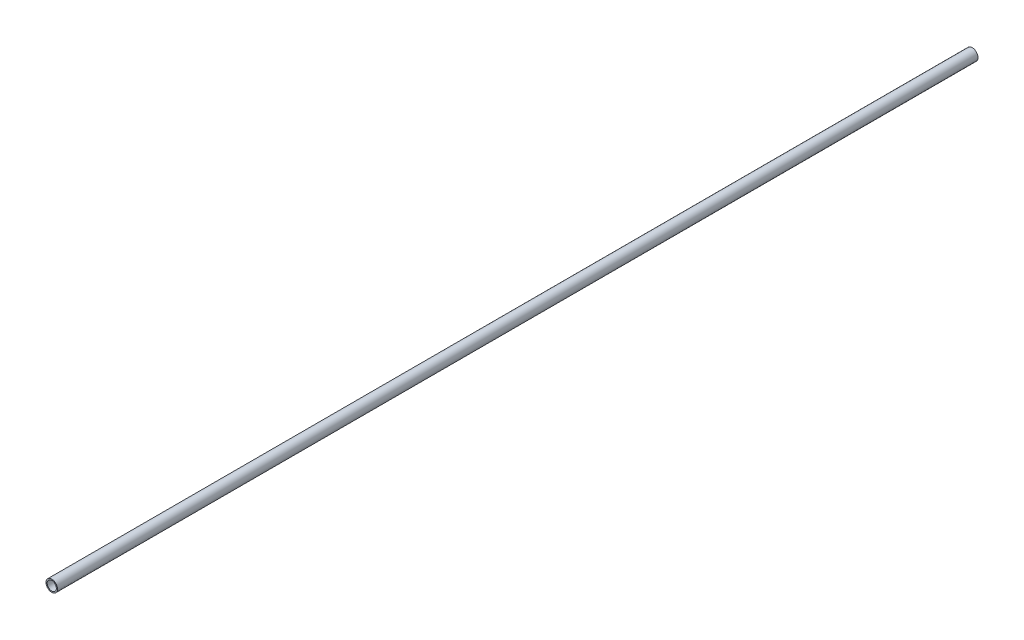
from build123d import *

# Parameters (mm, degrees)
SKETCH_1_R      = 5
SKETCH_1_R_2    = 4
EXTRUDE_1_DEPTH = 800


with BuildPart() as part:
    # Sketch 1 → Extrude 1 (new body)
    with BuildSketch(Plane.XY):
        Circle(SKETCH_1_R)
        Circle(SKETCH_1_R_2, mode=Mode.SUBTRACT)
    extrude(amount=EXTRUDE_1_DEPTH)


solid = part.part
